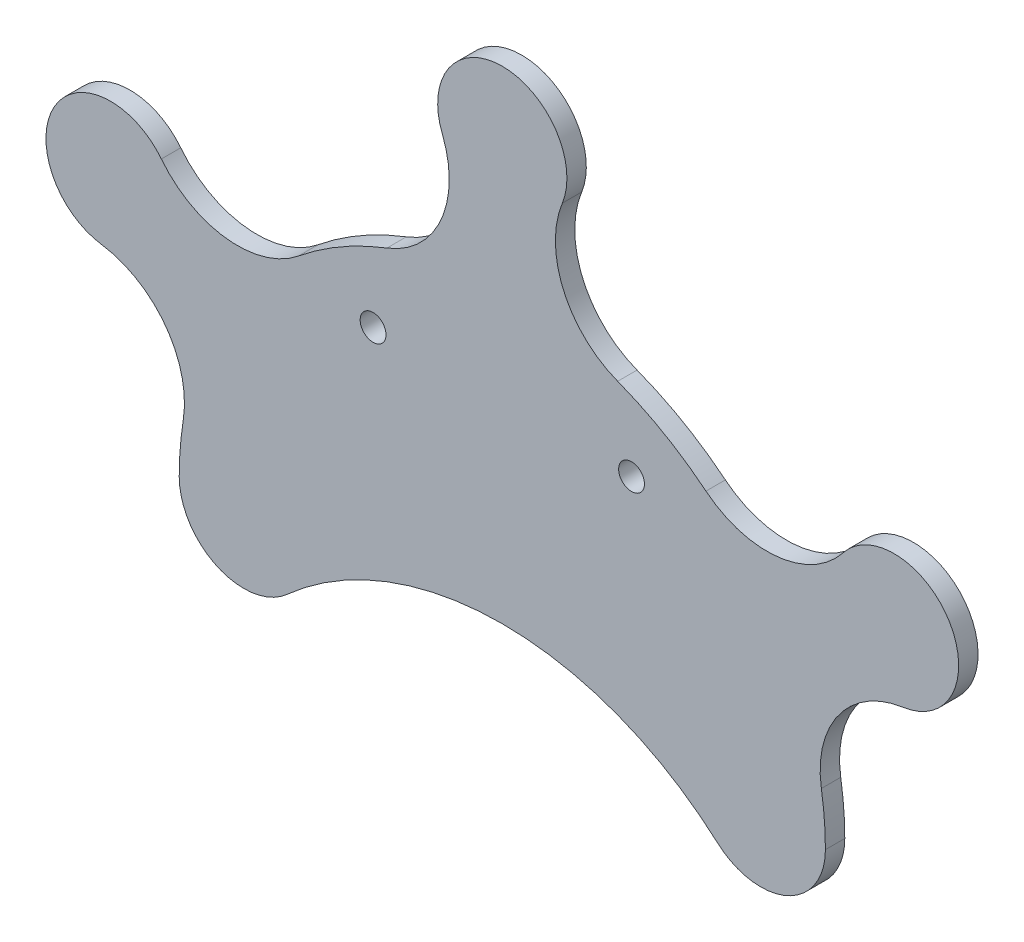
ISO-10303-21;
HEADER;
FILE_DESCRIPTION(('STEP AP214'),'2;1');
FILE_NAME('part.step','',(''),(''),'','','');
FILE_SCHEMA(('AUTOMOTIVE_DESIGN { 1 0 10303 214 1 1 1 1 }'));
ENDSEC;
DATA;
#1=APPLICATION_CONTEXT('core data for automotive mechanical design processes');
#2=APPLICATION_PROTOCOL_DEFINITION('international standard','automotive_design',2000,#1);
#3=PRODUCT_CONTEXT('',#1,'mechanical');
#4=PRODUCT('Part','Part','',(#3));
#5=PRODUCT_RELATED_PRODUCT_CATEGORY('part','',(#4));
#6=PRODUCT_DEFINITION_FORMATION('','',#4);
#7=PRODUCT_DEFINITION_CONTEXT('part definition',#1,'design');
#8=PRODUCT_DEFINITION('design','',#6,#7);
#9=PRODUCT_DEFINITION_SHAPE('','',#8);
#10=(LENGTH_UNIT() NAMED_UNIT(*) SI_UNIT(.MILLI.,.METRE.));
#11=(NAMED_UNIT(*) PLANE_ANGLE_UNIT() SI_UNIT($,.RADIAN.));
#12=(NAMED_UNIT(*) SI_UNIT($,.STERADIAN.) SOLID_ANGLE_UNIT());
#13=UNCERTAINTY_MEASURE_WITH_UNIT(LENGTH_MEASURE(1.E-05),#10,'distance_accuracy_value','');
#14=(GEOMETRIC_REPRESENTATION_CONTEXT(3) GLOBAL_UNCERTAINTY_ASSIGNED_CONTEXT((#13)) GLOBAL_UNIT_ASSIGNED_CONTEXT((#10,
#11,#12)) REPRESENTATION_CONTEXT('',''));
#15=CARTESIAN_POINT('',(0.,0.,0.));
#16=DIRECTION('',(0.,0.,1.));
#17=DIRECTION('',(1.,0.,0.));
#18=AXIS2_PLACEMENT_3D('',#15,#16,#17);
#19=CARTESIAN_POINT('',(-20.,-22.3606797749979,3.));
#20=DIRECTION('',(0.,0.,1.));
#21=DIRECTION('',(1.,0.,0.));
#22=AXIS2_PLACEMENT_3D('',#19,#20,#21);
#23=PLANE('',#22);
#24=CARTESIAN_POINT('',(20.,35.,3.));
#25=DIRECTION('',(0.,0.,1.));
#26=DIRECTION('',(1.,0.,0.));
#27=AXIS2_PLACEMENT_3D('',#24,#25,#26);
#28=CIRCLE('',#27,2.00000000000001);
#29=CARTESIAN_POINT('',(22.,35.,3.));
#30=VERTEX_POINT('',#29);
#31=EDGE_CURVE('E179',#30,#30,#28,.T.);
#32=ORIENTED_EDGE('',*,*,#31,.F.);
#33=EDGE_LOOP('',(#32));
#34=FACE_BOUND('',#33,.T.);
#35=CARTESIAN_POINT('',(0.,-44.7213595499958,3.));
#36=DIRECTION('',(0.,0.,-1.));
#37=DIRECTION('',(1.,0.,0.));
#38=AXIS2_PLACEMENT_3D('',#35,#36,#37);
#39=CIRCLE('',#38,50.);
#40=CARTESIAN_POINT('',(-33.3333333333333,-7.45355992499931,3.));
#41=VERTEX_POINT('',#40);
#42=CARTESIAN_POINT('',(33.3333333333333,-7.45355992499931,3.));
#43=VERTEX_POINT('',#42);
#44=EDGE_CURVE('E206',#41,#43,#39,.T.);
#45=ORIENTED_EDGE('',*,*,#44,.T.);
#46=CARTESIAN_POINT('',(40.,0.,3.));
#47=DIRECTION('',(0.,0.,1.));
#48=DIRECTION('',(-1.,0.,0.));
#49=AXIS2_PLACEMENT_3D('',#46,#47,#48);
#50=CIRCLE('',#49,10.);
#51=CARTESIAN_POINT('',(50.,0.,3.));
#52=VERTEX_POINT('',#51);
#53=EDGE_CURVE('E114',#43,#52,#50,.T.);
#54=ORIENTED_EDGE('',*,*,#53,.T.);
#55=CARTESIAN_POINT('',(0.,0.,3.));
#56=DIRECTION('',(0.,0.,1.));
#57=DIRECTION('',(-1.,0.,0.));
#58=AXIS2_PLACEMENT_3D('',#55,#56,#57);
#59=CIRCLE('',#58,50.);
#60=CARTESIAN_POINT('',(49.3737561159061,7.88873925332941,3.));
#61=VERTEX_POINT('',#60);
#62=EDGE_CURVE('E245',#52,#61,#59,.T.);
#63=ORIENTED_EDGE('',*,*,#62,.T.);
#64=CARTESIAN_POINT('',(64.185882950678,10.2553610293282,3.));
#65=DIRECTION('',(0.,0.,-1.));
#66=DIRECTION('',(-1.,0.,0.));
#67=AXIS2_PLACEMENT_3D('',#64,#65,#66);
#68=CIRCLE('',#67,15.);
#69=CARTESIAN_POINT('',(62.0474201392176,25.1021444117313,3.));
#70=VERTEX_POINT('',#69);
#71=EDGE_CURVE('E264',#61,#70,#68,.T.);
#72=ORIENTED_EDGE('',*,*,#71,.T.);
#73=CARTESIAN_POINT('',(60.6217782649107,35.0000000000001,3.));
#74=DIRECTION('',(0.,0.,1.));
#75=DIRECTION('',(-1.,0.,0.));
#76=AXIS2_PLACEMENT_3D('',#73,#74,#75);
#77=CIRCLE('',#76,9.99999999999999);
#78=CARTESIAN_POINT('',(52.7628048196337,41.1835698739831,3.));
#79=VERTEX_POINT('',#78);
#80=EDGE_CURVE('E261',#70,#79,#77,.T.);
#81=ORIENTED_EDGE('',*,*,#80,.T.);
#82=CARTESIAN_POINT('',(40.9743446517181,50.4589246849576,3.));
#83=DIRECTION('',(0.,0.,-1.));
#84=DIRECTION('',(-1.,0.,0.));
#85=AXIS2_PLACEMENT_3D('',#82,#83,#84);
#86=CIRCLE('',#85,15.);
#87=CARTESIAN_POINT('',(31.5187266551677,38.8145574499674,3.));
#88=VERTEX_POINT('',#87);
#89=EDGE_CURVE('E263',#79,#88,#86,.T.);
#90=ORIENTED_EDGE('',*,*,#89,.T.);
#91=CARTESIAN_POINT('',(0.,0.,3.));
#92=DIRECTION('',(0.,0.,1.));
#93=DIRECTION('',(-1.,0.,0.));
#94=AXIS2_PLACEMENT_3D('',#91,#92,#93);
#95=CIRCLE('',#94,50.);
#96=CARTESIAN_POINT('',(17.8550294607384,46.7032967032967,3.));
#97=VERTEX_POINT('',#96);
#98=EDGE_CURVE('E266',#88,#97,#95,.T.);
#99=ORIENTED_EDGE('',*,*,#98,.T.);
#100=CARTESIAN_POINT('',(23.2115382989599,60.7142857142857,3.));
#101=DIRECTION('',(0.,0.,-1.));
#102=DIRECTION('',(-1.,0.,0.));
#103=AXIS2_PLACEMENT_3D('',#100,#101,#102);
#104=CIRCLE('',#103,15.);
#105=CARTESIAN_POINT('',(9.28461531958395,66.2857142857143,3.));
#106=VERTEX_POINT('',#105);
#107=EDGE_CURVE('E272',#97,#106,#104,.T.);
#108=ORIENTED_EDGE('',*,*,#107,.T.);
#109=CARTESIAN_POINT('',(0.,70.,3.));
#110=DIRECTION('',(0.,0.,1.));
#111=DIRECTION('',(1.,0.,0.));
#112=AXIS2_PLACEMENT_3D('',#109,#110,#111);
#113=CIRCLE('',#112,10.);
#114=CARTESIAN_POINT('',(-9.28461531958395,66.2857142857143,3.));
#115=VERTEX_POINT('',#114);
#116=EDGE_CURVE('E274',#106,#115,#113,.T.);
#117=ORIENTED_EDGE('',*,*,#116,.T.);
#118=CARTESIAN_POINT('',(-23.2115382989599,60.7142857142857,3.));
#119=DIRECTION('',(0.,0.,-1.));
#120=DIRECTION('',(1.,0.,0.));
#121=AXIS2_PLACEMENT_3D('',#118,#119,#120);
#122=CIRCLE('',#121,15.);
#123=CARTESIAN_POINT('',(-17.8550294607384,46.7032967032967,3.));
#124=VERTEX_POINT('',#123);
#125=EDGE_CURVE('E276',#115,#124,#122,.T.);
#126=ORIENTED_EDGE('',*,*,#125,.T.);
#127=CARTESIAN_POINT('',(0.,0.,3.));
#128=DIRECTION('',(0.,0.,1.));
#129=DIRECTION('',(1.,0.,0.));
#130=AXIS2_PLACEMENT_3D('',#127,#128,#129);
#131=CIRCLE('',#130,50.);
#132=CARTESIAN_POINT('',(-31.5187266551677,38.8145574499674,3.));
#133=VERTEX_POINT('',#132);
#134=EDGE_CURVE('E278',#124,#133,#131,.T.);
#135=ORIENTED_EDGE('',*,*,#134,.T.);
#136=CARTESIAN_POINT('',(-40.9743446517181,50.4589246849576,3.));
#137=DIRECTION('',(0.,0.,-1.));
#138=DIRECTION('',(1.,0.,0.));
#139=AXIS2_PLACEMENT_3D('',#136,#137,#138);
#140=CIRCLE('',#139,15.);
#141=CARTESIAN_POINT('',(-52.7628048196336,41.1835698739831,3.));
#142=VERTEX_POINT('',#141);
#143=EDGE_CURVE('E280',#133,#142,#140,.T.);
#144=ORIENTED_EDGE('',*,*,#143,.T.);
#145=CARTESIAN_POINT('',(-60.6217782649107,35.0000000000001,3.));
#146=DIRECTION('',(0.,0.,1.));
#147=DIRECTION('',(1.,0.,0.));
#148=AXIS2_PLACEMENT_3D('',#145,#146,#147);
#149=CIRCLE('',#148,9.99999999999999);
#150=CARTESIAN_POINT('',(-62.0474201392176,25.1021444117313,3.));
#151=VERTEX_POINT('',#150);
#152=EDGE_CURVE('E157',#142,#151,#149,.T.);
#153=ORIENTED_EDGE('',*,*,#152,.T.);
#154=CARTESIAN_POINT('',(-64.185882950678,10.2553610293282,3.));
#155=DIRECTION('',(0.,0.,-1.));
#156=DIRECTION('',(1.,0.,0.));
#157=AXIS2_PLACEMENT_3D('',#154,#155,#156);
#158=CIRCLE('',#157,15.);
#159=CARTESIAN_POINT('',(-49.3737561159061,7.88873925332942,3.));
#160=VERTEX_POINT('',#159);
#161=EDGE_CURVE('E151',#151,#160,#158,.T.);
#162=ORIENTED_EDGE('',*,*,#161,.T.);
#163=CARTESIAN_POINT('',(0.,0.,3.));
#164=DIRECTION('',(0.,0.,1.));
#165=DIRECTION('',(1.,0.,0.));
#166=AXIS2_PLACEMENT_3D('',#163,#164,#165);
#167=CIRCLE('',#166,50.);
#168=CARTESIAN_POINT('',(-50.,0.,3.));
#169=VERTEX_POINT('',#168);
#170=EDGE_CURVE('E155',#160,#169,#167,.T.);
#171=ORIENTED_EDGE('',*,*,#170,.T.);
#172=CARTESIAN_POINT('',(-40.,0.,3.));
#173=DIRECTION('',(0.,0.,1.));
#174=DIRECTION('',(1.,0.,0.));
#175=AXIS2_PLACEMENT_3D('',#172,#173,#174);
#176=CIRCLE('',#175,10.);
#177=EDGE_CURVE('E47',#169,#41,#176,.T.);
#178=ORIENTED_EDGE('',*,*,#177,.T.);
#179=EDGE_LOOP('',(#45,#54,#63,#72,#81,#90,#99,#108,#117,#126,#135,#144,#153,#162,#171,#178));
#180=FACE_BOUND('',#179,.T.);
#181=CARTESIAN_POINT('',(-20.,35.,3.));
#182=DIRECTION('',(0.,0.,1.));
#183=DIRECTION('',(1.,0.,0.));
#184=AXIS2_PLACEMENT_3D('',#181,#182,#183);
#185=CIRCLE('',#184,2.);
#186=CARTESIAN_POINT('',(-18.,35.,3.));
#187=VERTEX_POINT('',#186);
#188=EDGE_CURVE('E323',#187,#187,#185,.T.);
#189=ORIENTED_EDGE('',*,*,#188,.F.);
#190=EDGE_LOOP('',(#189));
#191=FACE_BOUND('',#190,.T.);
#192=ADVANCED_FACE('F30',(#34,#180,#191),#23,.T.);
#193=CARTESIAN_POINT('',(-20.,-22.3606797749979,0.));
#194=DIRECTION('',(0.,0.,1.));
#195=DIRECTION('',(1.,0.,0.));
#196=AXIS2_PLACEMENT_3D('',#193,#194,#195);
#197=PLANE('',#196);
#198=CARTESIAN_POINT('',(20.,35.,0.));
#199=DIRECTION('',(0.,0.,1.));
#200=DIRECTION('',(1.,0.,0.));
#201=AXIS2_PLACEMENT_3D('',#198,#199,#200);
#202=CIRCLE('',#201,2.00000000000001);
#203=CARTESIAN_POINT('',(22.,35.,0.));
#204=VERTEX_POINT('',#203);
#205=EDGE_CURVE('E328',#204,#204,#202,.T.);
#206=ORIENTED_EDGE('',*,*,#205,.T.);
#207=EDGE_LOOP('',(#206));
#208=FACE_BOUND('',#207,.T.);
#209=CARTESIAN_POINT('',(0.,-44.7213595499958,0.));
#210=DIRECTION('',(0.,0.,-1.));
#211=DIRECTION('',(1.,0.,0.));
#212=AXIS2_PLACEMENT_3D('',#209,#210,#211);
#213=CIRCLE('',#212,50.);
#214=CARTESIAN_POINT('',(-33.3333333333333,-7.45355992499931,0.));
#215=VERTEX_POINT('',#214);
#216=CARTESIAN_POINT('',(33.3333333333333,-7.45355992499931,0.));
#217=VERTEX_POINT('',#216);
#218=EDGE_CURVE('E175',#215,#217,#213,.T.);
#219=ORIENTED_EDGE('',*,*,#218,.F.);
#220=CARTESIAN_POINT('',(-40.,0.,0.));
#221=DIRECTION('',(0.,0.,1.));
#222=DIRECTION('',(1.,0.,0.));
#223=AXIS2_PLACEMENT_3D('',#220,#221,#222);
#224=CIRCLE('',#223,10.);
#225=CARTESIAN_POINT('',(-50.,0.,0.));
#226=VERTEX_POINT('',#225);
#227=EDGE_CURVE('E106',#226,#215,#224,.T.);
#228=ORIENTED_EDGE('',*,*,#227,.F.);
#229=CARTESIAN_POINT('',(0.,0.,0.));
#230=DIRECTION('',(0.,0.,1.));
#231=DIRECTION('',(1.,0.,0.));
#232=AXIS2_PLACEMENT_3D('',#229,#230,#231);
#233=CIRCLE('',#232,50.);
#234=CARTESIAN_POINT('',(-49.3737561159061,7.88873925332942,0.));
#235=VERTEX_POINT('',#234);
#236=EDGE_CURVE('E100',#235,#226,#233,.T.);
#237=ORIENTED_EDGE('',*,*,#236,.F.);
#238=CARTESIAN_POINT('',(-64.185882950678,10.2553610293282,0.));
#239=DIRECTION('',(0.,0.,-1.));
#240=DIRECTION('',(1.,0.,0.));
#241=AXIS2_PLACEMENT_3D('',#238,#239,#240);
#242=CIRCLE('',#241,15.);
#243=CARTESIAN_POINT('',(-62.0474201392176,25.1021444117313,0.));
#244=VERTEX_POINT('',#243);
#245=EDGE_CURVE('E165',#244,#235,#242,.T.);
#246=ORIENTED_EDGE('',*,*,#245,.F.);
#247=CARTESIAN_POINT('',(-60.6217782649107,35.0000000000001,0.));
#248=DIRECTION('',(0.,0.,1.));
#249=DIRECTION('',(1.,0.,0.));
#250=AXIS2_PLACEMENT_3D('',#247,#248,#249);
#251=CIRCLE('',#250,9.99999999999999);
#252=CARTESIAN_POINT('',(-52.7628048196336,41.1835698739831,0.));
#253=VERTEX_POINT('',#252);
#254=EDGE_CURVE('E201',#253,#244,#251,.T.);
#255=ORIENTED_EDGE('',*,*,#254,.F.);
#256=CARTESIAN_POINT('',(-40.9743446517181,50.4589246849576,0.));
#257=DIRECTION('',(0.,0.,-1.));
#258=DIRECTION('',(1.,0.,0.));
#259=AXIS2_PLACEMENT_3D('',#256,#257,#258);
#260=CIRCLE('',#259,15.);
#261=CARTESIAN_POINT('',(-31.5187266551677,38.8145574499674,0.));
#262=VERTEX_POINT('',#261);
#263=EDGE_CURVE('E199',#262,#253,#260,.T.);
#264=ORIENTED_EDGE('',*,*,#263,.F.);
#265=CARTESIAN_POINT('',(0.,0.,0.));
#266=DIRECTION('',(0.,0.,1.));
#267=DIRECTION('',(1.,0.,0.));
#268=AXIS2_PLACEMENT_3D('',#265,#266,#267);
#269=CIRCLE('',#268,50.);
#270=CARTESIAN_POINT('',(-17.8550294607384,46.7032967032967,0.));
#271=VERTEX_POINT('',#270);
#272=EDGE_CURVE('E197',#271,#262,#269,.T.);
#273=ORIENTED_EDGE('',*,*,#272,.F.);
#274=CARTESIAN_POINT('',(-23.2115382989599,60.7142857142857,0.));
#275=DIRECTION('',(0.,0.,-1.));
#276=DIRECTION('',(1.,0.,0.));
#277=AXIS2_PLACEMENT_3D('',#274,#275,#276);
#278=CIRCLE('',#277,15.);
#279=CARTESIAN_POINT('',(-9.28461531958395,66.2857142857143,0.));
#280=VERTEX_POINT('',#279);
#281=EDGE_CURVE('E195',#280,#271,#278,.T.);
#282=ORIENTED_EDGE('',*,*,#281,.F.);
#283=CARTESIAN_POINT('',(0.,70.,0.));
#284=DIRECTION('',(0.,0.,1.));
#285=DIRECTION('',(1.,0.,0.));
#286=AXIS2_PLACEMENT_3D('',#283,#284,#285);
#287=CIRCLE('',#286,10.);
#288=CARTESIAN_POINT('',(9.28461531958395,66.2857142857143,0.));
#289=VERTEX_POINT('',#288);
#290=EDGE_CURVE('E193',#289,#280,#287,.T.);
#291=ORIENTED_EDGE('',*,*,#290,.F.);
#292=CARTESIAN_POINT('',(23.2115382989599,60.7142857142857,0.));
#293=DIRECTION('',(0.,0.,-1.));
#294=DIRECTION('',(-1.,0.,0.));
#295=AXIS2_PLACEMENT_3D('',#292,#293,#294);
#296=CIRCLE('',#295,15.);
#297=CARTESIAN_POINT('',(17.8550294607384,46.7032967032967,0.));
#298=VERTEX_POINT('',#297);
#299=EDGE_CURVE('E191',#298,#289,#296,.T.);
#300=ORIENTED_EDGE('',*,*,#299,.F.);
#301=CARTESIAN_POINT('',(0.,0.,0.));
#302=DIRECTION('',(0.,0.,1.));
#303=DIRECTION('',(-1.,0.,0.));
#304=AXIS2_PLACEMENT_3D('',#301,#302,#303);
#305=CIRCLE('',#304,50.);
#306=CARTESIAN_POINT('',(31.5187266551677,38.8145574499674,0.));
#307=VERTEX_POINT('',#306);
#308=EDGE_CURVE('E189',#307,#298,#305,.T.);
#309=ORIENTED_EDGE('',*,*,#308,.F.);
#310=CARTESIAN_POINT('',(40.9743446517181,50.4589246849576,0.));
#311=DIRECTION('',(0.,0.,-1.));
#312=DIRECTION('',(-1.,0.,0.));
#313=AXIS2_PLACEMENT_3D('',#310,#311,#312);
#314=CIRCLE('',#313,15.);
#315=CARTESIAN_POINT('',(52.7628048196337,41.1835698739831,0.));
#316=VERTEX_POINT('',#315);
#317=EDGE_CURVE('E187',#316,#307,#314,.T.);
#318=ORIENTED_EDGE('',*,*,#317,.F.);
#319=CARTESIAN_POINT('',(60.6217782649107,35.0000000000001,0.));
#320=DIRECTION('',(0.,0.,1.));
#321=DIRECTION('',(-1.,0.,0.));
#322=AXIS2_PLACEMENT_3D('',#319,#320,#321);
#323=CIRCLE('',#322,9.99999999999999);
#324=CARTESIAN_POINT('',(62.0474201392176,25.1021444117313,0.));
#325=VERTEX_POINT('',#324);
#326=EDGE_CURVE('E185',#325,#316,#323,.T.);
#327=ORIENTED_EDGE('',*,*,#326,.F.);
#328=CARTESIAN_POINT('',(64.185882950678,10.2553610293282,0.));
#329=DIRECTION('',(0.,0.,-1.));
#330=DIRECTION('',(-1.,0.,0.));
#331=AXIS2_PLACEMENT_3D('',#328,#329,#330);
#332=CIRCLE('',#331,15.);
#333=CARTESIAN_POINT('',(49.3737561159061,7.88873925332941,0.));
#334=VERTEX_POINT('',#333);
#335=EDGE_CURVE('E183',#334,#325,#332,.T.);
#336=ORIENTED_EDGE('',*,*,#335,.F.);
#337=CARTESIAN_POINT('',(0.,0.,0.));
#338=DIRECTION('',(0.,0.,1.));
#339=DIRECTION('',(-1.,0.,0.));
#340=AXIS2_PLACEMENT_3D('',#337,#338,#339);
#341=CIRCLE('',#340,50.);
#342=CARTESIAN_POINT('',(50.,0.,0.));
#343=VERTEX_POINT('',#342);
#344=EDGE_CURVE('E181',#343,#334,#341,.T.);
#345=ORIENTED_EDGE('',*,*,#344,.F.);
#346=CARTESIAN_POINT('',(40.,0.,0.));
#347=DIRECTION('',(0.,0.,1.));
#348=DIRECTION('',(-1.,0.,0.));
#349=AXIS2_PLACEMENT_3D('',#346,#347,#348);
#350=CIRCLE('',#349,10.);
#351=EDGE_CURVE('E178',#217,#343,#350,.T.);
#352=ORIENTED_EDGE('',*,*,#351,.F.);
#353=EDGE_LOOP('',(#219,#228,#237,#246,#255,#264,#273,#282,#291,#300,#309,#318,#327,#336,#345,#352));
#354=FACE_BOUND('',#353,.T.);
#355=CARTESIAN_POINT('',(-20.,35.,0.));
#356=DIRECTION('',(0.,0.,1.));
#357=DIRECTION('',(1.,0.,0.));
#358=AXIS2_PLACEMENT_3D('',#355,#356,#357);
#359=CIRCLE('',#358,2.);
#360=CARTESIAN_POINT('',(-18.,35.,0.));
#361=VERTEX_POINT('',#360);
#362=EDGE_CURVE('E326',#361,#361,#359,.T.);
#363=ORIENTED_EDGE('',*,*,#362,.T.);
#364=EDGE_LOOP('',(#363));
#365=FACE_BOUND('',#364,.T.);
#366=ADVANCED_FACE('F249',(#208,#354,#365),#197,.F.);
#367=CARTESIAN_POINT('',(0.,-44.7213595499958,3.));
#368=DIRECTION('',(0.,0.,-1.));
#369=DIRECTION('',(-1.,0.,0.));
#370=AXIS2_PLACEMENT_3D('',#367,#368,#369);
#371=CYLINDRICAL_SURFACE('',#370,50.);
#372=ORIENTED_EDGE('',*,*,#218,.T.);
#373=DIRECTION('',(0.,0.,-1.));
#374=VECTOR('',#373,1.);
#375=CARTESIAN_POINT('',(33.3333333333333,-7.45355992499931,3.));
#376=LINE('',#375,#374);
#377=EDGE_CURVE('E11',#43,#217,#376,.T.);
#378=ORIENTED_EDGE('',*,*,#377,.F.);
#379=ORIENTED_EDGE('',*,*,#44,.F.);
#380=DIRECTION('',(0.,0.,-1.));
#381=VECTOR('',#380,1.);
#382=CARTESIAN_POINT('',(-33.3333333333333,-7.45355992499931,3.));
#383=LINE('',#382,#381);
#384=EDGE_CURVE('E171',#41,#215,#383,.T.);
#385=ORIENTED_EDGE('',*,*,#384,.T.);
#386=EDGE_LOOP('',(#372,#378,#379,#385));
#387=FACE_BOUND('',#386,.T.);
#388=ADVANCED_FACE('F32',(#387),#371,.F.);
#389=CARTESIAN_POINT('',(40.,0.,3.));
#390=DIRECTION('',(0.,0.,-1.));
#391=DIRECTION('',(-1.,0.,0.));
#392=AXIS2_PLACEMENT_3D('',#389,#390,#391);
#393=CYLINDRICAL_SURFACE('',#392,10.);
#394=ORIENTED_EDGE('',*,*,#351,.T.);
#395=DIRECTION('',(0.,0.,-1.));
#396=VECTOR('',#395,1.);
#397=CARTESIAN_POINT('',(50.,0.,3.));
#398=LINE('',#397,#396);
#399=EDGE_CURVE('E39',#52,#343,#398,.T.);
#400=ORIENTED_EDGE('',*,*,#399,.F.);
#401=ORIENTED_EDGE('',*,*,#53,.F.);
#402=ORIENTED_EDGE('',*,*,#377,.T.);
#403=EDGE_LOOP('',(#394,#400,#401,#402));
#404=FACE_BOUND('',#403,.T.);
#405=ADVANCED_FACE('F461',(#404),#393,.T.);
#406=CARTESIAN_POINT('',(0.,0.,3.));
#407=DIRECTION('',(0.,0.,-1.));
#408=DIRECTION('',(-1.,0.,0.));
#409=AXIS2_PLACEMENT_3D('',#406,#407,#408);
#410=CYLINDRICAL_SURFACE('',#409,50.);
#411=ORIENTED_EDGE('',*,*,#344,.T.);
#412=DIRECTION('',(0.,0.,-1.));
#413=VECTOR('',#412,1.);
#414=CARTESIAN_POINT('',(49.3737561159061,7.88873925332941,3.));
#415=LINE('',#414,#413);
#416=EDGE_CURVE('E237',#61,#334,#415,.T.);
#417=ORIENTED_EDGE('',*,*,#416,.F.);
#418=ORIENTED_EDGE('',*,*,#62,.F.);
#419=ORIENTED_EDGE('',*,*,#399,.T.);
#420=EDGE_LOOP('',(#411,#417,#418,#419));
#421=FACE_BOUND('',#420,.T.);
#422=ADVANCED_FACE('F243',(#421),#410,.T.);
#423=CARTESIAN_POINT('',(64.185882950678,10.2553610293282,3.));
#424=DIRECTION('',(0.,0.,-1.));
#425=DIRECTION('',(-1.,0.,0.));
#426=AXIS2_PLACEMENT_3D('',#423,#424,#425);
#427=CYLINDRICAL_SURFACE('',#426,15.);
#428=ORIENTED_EDGE('',*,*,#335,.T.);
#429=DIRECTION('',(0.,0.,-1.));
#430=VECTOR('',#429,1.);
#431=CARTESIAN_POINT('',(62.0474201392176,25.1021444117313,3.));
#432=LINE('',#431,#430);
#433=EDGE_CURVE('E234',#70,#325,#432,.T.);
#434=ORIENTED_EDGE('',*,*,#433,.F.);
#435=ORIENTED_EDGE('',*,*,#71,.F.);
#436=ORIENTED_EDGE('',*,*,#416,.T.);
#437=EDGE_LOOP('',(#428,#434,#435,#436));
#438=FACE_BOUND('',#437,.T.);
#439=ADVANCED_FACE('F255',(#438),#427,.F.);
#440=CARTESIAN_POINT('',(60.6217782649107,35.0000000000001,3.));
#441=DIRECTION('',(0.,0.,-1.));
#442=DIRECTION('',(-1.,0.,0.));
#443=AXIS2_PLACEMENT_3D('',#440,#441,#442);
#444=CYLINDRICAL_SURFACE('',#443,9.99999999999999);
#445=ORIENTED_EDGE('',*,*,#326,.T.);
#446=DIRECTION('',(0.,0.,-1.));
#447=VECTOR('',#446,1.);
#448=CARTESIAN_POINT('',(52.7628048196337,41.1835698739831,3.));
#449=LINE('',#448,#447);
#450=EDGE_CURVE('E231',#79,#316,#449,.T.);
#451=ORIENTED_EDGE('',*,*,#450,.F.);
#452=ORIENTED_EDGE('',*,*,#80,.F.);
#453=ORIENTED_EDGE('',*,*,#433,.T.);
#454=EDGE_LOOP('',(#445,#451,#452,#453));
#455=FACE_BOUND('',#454,.T.);
#456=ADVANCED_FACE('F259',(#455),#444,.T.);
#457=CARTESIAN_POINT('',(40.9743446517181,50.4589246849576,3.));
#458=DIRECTION('',(0.,0.,-1.));
#459=DIRECTION('',(-1.,0.,0.));
#460=AXIS2_PLACEMENT_3D('',#457,#458,#459);
#461=CYLINDRICAL_SURFACE('',#460,15.);
#462=ORIENTED_EDGE('',*,*,#317,.T.);
#463=DIRECTION('',(0.,0.,-1.));
#464=VECTOR('',#463,1.);
#465=CARTESIAN_POINT('',(31.5187266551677,38.8145574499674,3.));
#466=LINE('',#465,#464);
#467=EDGE_CURVE('E228',#88,#307,#466,.T.);
#468=ORIENTED_EDGE('',*,*,#467,.F.);
#469=ORIENTED_EDGE('',*,*,#89,.F.);
#470=ORIENTED_EDGE('',*,*,#450,.T.);
#471=EDGE_LOOP('',(#462,#468,#469,#470));
#472=FACE_BOUND('',#471,.T.);
#473=ADVANCED_FACE('F426',(#472),#461,.F.);
#474=CARTESIAN_POINT('',(0.,0.,3.));
#475=DIRECTION('',(0.,0.,-1.));
#476=DIRECTION('',(-1.,0.,0.));
#477=AXIS2_PLACEMENT_3D('',#474,#475,#476);
#478=CYLINDRICAL_SURFACE('',#477,50.);
#479=ORIENTED_EDGE('',*,*,#308,.T.);
#480=DIRECTION('',(0.,0.,-1.));
#481=VECTOR('',#480,1.);
#482=CARTESIAN_POINT('',(17.8550294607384,46.7032967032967,3.));
#483=LINE('',#482,#481);
#484=EDGE_CURVE('E225',#97,#298,#483,.T.);
#485=ORIENTED_EDGE('',*,*,#484,.F.);
#486=ORIENTED_EDGE('',*,*,#98,.F.);
#487=ORIENTED_EDGE('',*,*,#467,.T.);
#488=EDGE_LOOP('',(#479,#485,#486,#487));
#489=FACE_BOUND('',#488,.T.);
#490=ADVANCED_FACE('F416',(#489),#478,.T.);
#491=CARTESIAN_POINT('',(23.2115382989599,60.7142857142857,3.));
#492=DIRECTION('',(0.,0.,-1.));
#493=DIRECTION('',(-1.,0.,0.));
#494=AXIS2_PLACEMENT_3D('',#491,#492,#493);
#495=CYLINDRICAL_SURFACE('',#494,15.);
#496=ORIENTED_EDGE('',*,*,#299,.T.);
#497=DIRECTION('',(0.,0.,-1.));
#498=VECTOR('',#497,1.);
#499=CARTESIAN_POINT('',(9.28461531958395,66.2857142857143,3.));
#500=LINE('',#499,#498);
#501=EDGE_CURVE('E222',#106,#289,#500,.T.);
#502=ORIENTED_EDGE('',*,*,#501,.F.);
#503=ORIENTED_EDGE('',*,*,#107,.F.);
#504=ORIENTED_EDGE('',*,*,#484,.T.);
#505=EDGE_LOOP('',(#496,#502,#503,#504));
#506=FACE_BOUND('',#505,.T.);
#507=ADVANCED_FACE('F406',(#506),#495,.F.);
#508=CARTESIAN_POINT('',(0.,70.,3.));
#509=DIRECTION('',(0.,0.,-1.));
#510=DIRECTION('',(-1.,0.,0.));
#511=AXIS2_PLACEMENT_3D('',#508,#509,#510);
#512=CYLINDRICAL_SURFACE('',#511,10.);
#513=ORIENTED_EDGE('',*,*,#290,.T.);
#514=DIRECTION('',(0.,0.,-1.));
#515=VECTOR('',#514,1.);
#516=CARTESIAN_POINT('',(-9.28461531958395,66.2857142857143,3.));
#517=LINE('',#516,#515);
#518=EDGE_CURVE('E219',#115,#280,#517,.T.);
#519=ORIENTED_EDGE('',*,*,#518,.F.);
#520=ORIENTED_EDGE('',*,*,#116,.F.);
#521=ORIENTED_EDGE('',*,*,#501,.T.);
#522=EDGE_LOOP('',(#513,#519,#520,#521));
#523=FACE_BOUND('',#522,.T.);
#524=ADVANCED_FACE('F396',(#523),#512,.T.);
#525=CARTESIAN_POINT('',(-23.2115382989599,60.7142857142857,3.));
#526=DIRECTION('',(0.,0.,-1.));
#527=DIRECTION('',(-1.,0.,0.));
#528=AXIS2_PLACEMENT_3D('',#525,#526,#527);
#529=CYLINDRICAL_SURFACE('',#528,15.);
#530=ORIENTED_EDGE('',*,*,#281,.T.);
#531=DIRECTION('',(0.,0.,-1.));
#532=VECTOR('',#531,1.);
#533=CARTESIAN_POINT('',(-17.8550294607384,46.7032967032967,3.));
#534=LINE('',#533,#532);
#535=EDGE_CURVE('E216',#124,#271,#534,.T.);
#536=ORIENTED_EDGE('',*,*,#535,.F.);
#537=ORIENTED_EDGE('',*,*,#125,.F.);
#538=ORIENTED_EDGE('',*,*,#518,.T.);
#539=EDGE_LOOP('',(#530,#536,#537,#538));
#540=FACE_BOUND('',#539,.T.);
#541=ADVANCED_FACE('F386',(#540),#529,.F.);
#542=CARTESIAN_POINT('',(0.,0.,3.));
#543=DIRECTION('',(0.,0.,-1.));
#544=DIRECTION('',(-1.,0.,0.));
#545=AXIS2_PLACEMENT_3D('',#542,#543,#544);
#546=CYLINDRICAL_SURFACE('',#545,50.);
#547=ORIENTED_EDGE('',*,*,#272,.T.);
#548=DIRECTION('',(0.,0.,-1.));
#549=VECTOR('',#548,1.);
#550=CARTESIAN_POINT('',(-31.5187266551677,38.8145574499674,3.));
#551=LINE('',#550,#549);
#552=EDGE_CURVE('E213',#133,#262,#551,.T.);
#553=ORIENTED_EDGE('',*,*,#552,.F.);
#554=ORIENTED_EDGE('',*,*,#134,.F.);
#555=ORIENTED_EDGE('',*,*,#535,.T.);
#556=EDGE_LOOP('',(#547,#553,#554,#555));
#557=FACE_BOUND('',#556,.T.);
#558=ADVANCED_FACE('F377',(#557),#546,.T.);
#559=CARTESIAN_POINT('',(-40.9743446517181,50.4589246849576,3.));
#560=DIRECTION('',(0.,0.,-1.));
#561=DIRECTION('',(-1.,0.,0.));
#562=AXIS2_PLACEMENT_3D('',#559,#560,#561);
#563=CYLINDRICAL_SURFACE('',#562,15.);
#564=ORIENTED_EDGE('',*,*,#263,.T.);
#565=DIRECTION('',(0.,0.,-1.));
#566=VECTOR('',#565,1.);
#567=CARTESIAN_POINT('',(-52.7628048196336,41.1835698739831,3.));
#568=LINE('',#567,#566);
#569=EDGE_CURVE('E210',#142,#253,#568,.T.);
#570=ORIENTED_EDGE('',*,*,#569,.F.);
#571=ORIENTED_EDGE('',*,*,#143,.F.);
#572=ORIENTED_EDGE('',*,*,#552,.T.);
#573=EDGE_LOOP('',(#564,#570,#571,#572));
#574=FACE_BOUND('',#573,.T.);
#575=ADVANCED_FACE('F286',(#574),#563,.F.);
#576=CARTESIAN_POINT('',(-60.6217782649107,35.0000000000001,3.));
#577=DIRECTION('',(0.,0.,-1.));
#578=DIRECTION('',(-1.,0.,0.));
#579=AXIS2_PLACEMENT_3D('',#576,#577,#578);
#580=CYLINDRICAL_SURFACE('',#579,9.99999999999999);
#581=ORIENTED_EDGE('',*,*,#254,.T.);
#582=DIRECTION('',(0.,0.,-1.));
#583=VECTOR('',#582,1.);
#584=CARTESIAN_POINT('',(-62.0474201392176,25.1021444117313,3.));
#585=LINE('',#584,#583);
#586=EDGE_CURVE('E166',#151,#244,#585,.T.);
#587=ORIENTED_EDGE('',*,*,#586,.F.);
#588=ORIENTED_EDGE('',*,*,#152,.F.);
#589=ORIENTED_EDGE('',*,*,#569,.T.);
#590=EDGE_LOOP('',(#581,#587,#588,#589));
#591=FACE_BOUND('',#590,.T.);
#592=ADVANCED_FACE('F290',(#591),#580,.T.);
#593=CARTESIAN_POINT('',(-64.185882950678,10.2553610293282,3.));
#594=DIRECTION('',(0.,0.,-1.));
#595=DIRECTION('',(-1.,0.,0.));
#596=AXIS2_PLACEMENT_3D('',#593,#594,#595);
#597=CYLINDRICAL_SURFACE('',#596,15.);
#598=ORIENTED_EDGE('',*,*,#245,.T.);
#599=DIRECTION('',(0.,0.,-1.));
#600=VECTOR('',#599,1.);
#601=CARTESIAN_POINT('',(-49.3737561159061,7.88873925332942,3.));
#602=LINE('',#601,#600);
#603=EDGE_CURVE('E162',#160,#235,#602,.T.);
#604=ORIENTED_EDGE('',*,*,#603,.F.);
#605=ORIENTED_EDGE('',*,*,#161,.F.);
#606=ORIENTED_EDGE('',*,*,#586,.T.);
#607=EDGE_LOOP('',(#598,#604,#605,#606));
#608=FACE_BOUND('',#607,.T.);
#609=ADVANCED_FACE('F163',(#608),#597,.F.);
#610=CARTESIAN_POINT('',(0.,0.,3.));
#611=DIRECTION('',(0.,0.,-1.));
#612=DIRECTION('',(-1.,0.,0.));
#613=AXIS2_PLACEMENT_3D('',#610,#611,#612);
#614=CYLINDRICAL_SURFACE('',#613,50.);
#615=ORIENTED_EDGE('',*,*,#236,.T.);
#616=DIRECTION('',(0.,0.,-1.));
#617=VECTOR('',#616,1.);
#618=CARTESIAN_POINT('',(-50.,0.,3.));
#619=LINE('',#618,#617);
#620=EDGE_CURVE('E167',#169,#226,#619,.T.);
#621=ORIENTED_EDGE('',*,*,#620,.F.);
#622=ORIENTED_EDGE('',*,*,#170,.F.);
#623=ORIENTED_EDGE('',*,*,#603,.T.);
#624=EDGE_LOOP('',(#615,#621,#622,#623));
#625=FACE_BOUND('',#624,.T.);
#626=ADVANCED_FACE('F169',(#625),#614,.T.);
#627=CARTESIAN_POINT('',(-40.,0.,3.));
#628=DIRECTION('',(0.,0.,-1.));
#629=DIRECTION('',(-1.,0.,0.));
#630=AXIS2_PLACEMENT_3D('',#627,#628,#629);
#631=CYLINDRICAL_SURFACE('',#630,10.);
#632=ORIENTED_EDGE('',*,*,#227,.T.);
#633=ORIENTED_EDGE('',*,*,#384,.F.);
#634=ORIENTED_EDGE('',*,*,#177,.F.);
#635=ORIENTED_EDGE('',*,*,#620,.T.);
#636=EDGE_LOOP('',(#632,#633,#634,#635));
#637=FACE_BOUND('',#636,.T.);
#638=ADVANCED_FACE('F294',(#637),#631,.T.);
#639=CARTESIAN_POINT('',(20.,35.,3.));
#640=DIRECTION('',(0.,0.,-1.));
#641=DIRECTION('',(-1.,0.,0.));
#642=AXIS2_PLACEMENT_3D('',#639,#640,#641);
#643=CYLINDRICAL_SURFACE('',#642,2.00000000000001);
#644=ORIENTED_EDGE('',*,*,#31,.T.);
#645=EDGE_LOOP('',(#644));
#646=FACE_BOUND('',#645,.T.);
#647=ORIENTED_EDGE('',*,*,#205,.F.);
#648=EDGE_LOOP('',(#647));
#649=FACE_BOUND('',#648,.T.);
#650=ADVANCED_FACE('F296',(#646,#649),#643,.F.);
#651=CARTESIAN_POINT('',(-20.,35.,3.));
#652=DIRECTION('',(0.,0.,-1.));
#653=DIRECTION('',(-1.,0.,0.));
#654=AXIS2_PLACEMENT_3D('',#651,#652,#653);
#655=CYLINDRICAL_SURFACE('',#654,2.);
#656=ORIENTED_EDGE('',*,*,#188,.T.);
#657=EDGE_LOOP('',(#656));
#658=FACE_BOUND('',#657,.T.);
#659=ORIENTED_EDGE('',*,*,#362,.F.);
#660=EDGE_LOOP('',(#659));
#661=FACE_BOUND('',#660,.T.);
#662=ADVANCED_FACE('F302',(#658,#661),#655,.F.);
#663=CLOSED_SHELL('',(#192,#366,#388,#405,#422,#439,#456,#473,#490,#507,#524,#541,#558,#575,
#592,#609,#626,#638,#650,#662));
#664=MANIFOLD_SOLID_BREP('B2',#663);
#665=ADVANCED_BREP_SHAPE_REPRESENTATION('',(#18,#664),#14);
#666=SHAPE_DEFINITION_REPRESENTATION(#9,#665);
ENDSEC;
END-ISO-10303-21;
